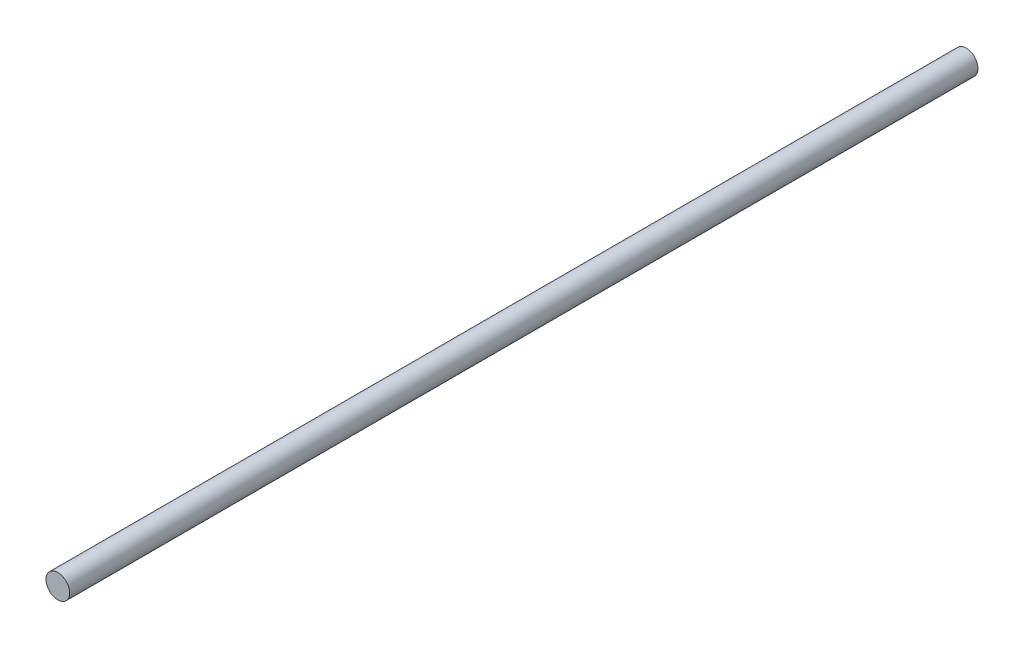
from build123d import *

# Parameters (mm, degrees)
SKETCH1_R           = 30
BOSS_EXTRUDE1_DEPTH = 2300


with BuildPart() as part:
    # Sketch1 → Boss-Extrude1 (new body)
    with BuildSketch(Plane.XY):
        Circle(SKETCH1_R)
    extrude(amount=-BOSS_EXTRUDE1_DEPTH)


solid = part.part
